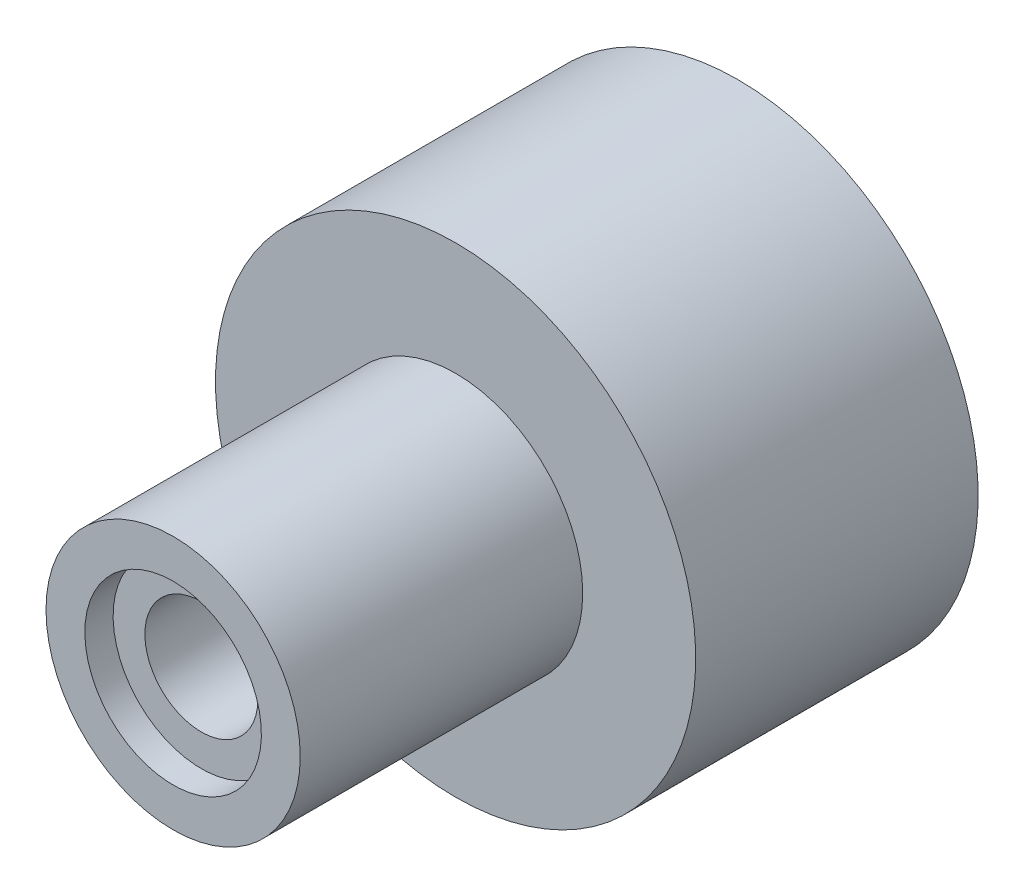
ISO-10303-21;
HEADER;
FILE_DESCRIPTION(('STEP AP214'),'2;1');
FILE_NAME('part.step','',(''),(''),'','','');
FILE_SCHEMA(('AUTOMOTIVE_DESIGN { 1 0 10303 214 1 1 1 1 }'));
ENDSEC;
DATA;
#1=APPLICATION_CONTEXT('core data for automotive mechanical design processes');
#2=APPLICATION_PROTOCOL_DEFINITION('international standard','automotive_design',2000,#1);
#3=PRODUCT_CONTEXT('',#1,'mechanical');
#4=PRODUCT('Part','Part','',(#3));
#5=PRODUCT_RELATED_PRODUCT_CATEGORY('part','',(#4));
#6=PRODUCT_DEFINITION_FORMATION('','',#4);
#7=PRODUCT_DEFINITION_CONTEXT('part definition',#1,'design');
#8=PRODUCT_DEFINITION('design','',#6,#7);
#9=PRODUCT_DEFINITION_SHAPE('','',#8);
#10=(LENGTH_UNIT() NAMED_UNIT(*) SI_UNIT(.MILLI.,.METRE.));
#11=(NAMED_UNIT(*) PLANE_ANGLE_UNIT() SI_UNIT($,.RADIAN.));
#12=(NAMED_UNIT(*) SI_UNIT($,.STERADIAN.) SOLID_ANGLE_UNIT());
#13=UNCERTAINTY_MEASURE_WITH_UNIT(LENGTH_MEASURE(1.E-05),#10,'distance_accuracy_value','');
#14=(GEOMETRIC_REPRESENTATION_CONTEXT(3) GLOBAL_UNCERTAINTY_ASSIGNED_CONTEXT((#13)) GLOBAL_UNIT_ASSIGNED_CONTEXT((#10,
#11,#12)) REPRESENTATION_CONTEXT('',''));
#15=CARTESIAN_POINT('',(0.,0.,0.));
#16=DIRECTION('',(0.,0.,1.));
#17=DIRECTION('',(1.,0.,0.));
#18=AXIS2_PLACEMENT_3D('',#15,#16,#17);
#19=CARTESIAN_POINT('',(0.,0.,0.));
#20=DIRECTION('',(0.,0.,-1.));
#21=DIRECTION('',(0.,1.,0.));
#22=AXIS2_PLACEMENT_3D('',#19,#20,#21);
#23=CYLINDRICAL_SURFACE('',#22,17.);
#24=CARTESIAN_POINT('',(0.,0.,20.));
#25=DIRECTION('',(0.,0.,-1.));
#26=DIRECTION('',(0.,1.,0.));
#27=AXIS2_PLACEMENT_3D('',#24,#25,#26);
#28=CIRCLE('',#27,17.);
#29=CARTESIAN_POINT('',(0.,17.,20.));
#30=VERTEX_POINT('',#29);
#31=EDGE_CURVE('E41',#30,#30,#28,.T.);
#32=ORIENTED_EDGE('',*,*,#31,.T.);
#33=EDGE_LOOP('',(#32));
#34=FACE_BOUND('',#33,.T.);
#35=CARTESIAN_POINT('',(0.,0.,0.));
#36=DIRECTION('',(0.,0.,-1.));
#37=DIRECTION('',(0.,1.,0.));
#38=AXIS2_PLACEMENT_3D('',#35,#36,#37);
#39=CIRCLE('',#38,17.);
#40=CARTESIAN_POINT('',(0.,17.,0.));
#41=VERTEX_POINT('',#40);
#42=EDGE_CURVE('E44',#41,#41,#39,.T.);
#43=ORIENTED_EDGE('',*,*,#42,.F.);
#44=EDGE_LOOP('',(#43));
#45=FACE_BOUND('',#44,.T.);
#46=ADVANCED_FACE('F12',(#34,#45),#23,.T.);
#47=CARTESIAN_POINT('',(0.,0.,0.));
#48=DIRECTION('',(0.,0.,-1.));
#49=DIRECTION('',(0.,1.,0.));
#50=AXIS2_PLACEMENT_3D('',#47,#48,#49);
#51=CYLINDRICAL_SURFACE('',#50,4.);
#52=CARTESIAN_POINT('',(0.,0.,15.));
#53=DIRECTION('',(0.,0.,-1.));
#54=DIRECTION('',(0.,1.,0.));
#55=AXIS2_PLACEMENT_3D('',#52,#53,#54);
#56=CIRCLE('',#55,4.);
#57=CARTESIAN_POINT('',(0.,4.,15.));
#58=VERTEX_POINT('',#57);
#59=EDGE_CURVE('E19',#58,#58,#56,.T.);
#60=ORIENTED_EDGE('',*,*,#59,.T.);
#61=EDGE_LOOP('',(#60));
#62=FACE_BOUND('',#61,.T.);
#63=CARTESIAN_POINT('',(0.,0.,38.));
#64=DIRECTION('',(0.,0.,-1.));
#65=DIRECTION('',(0.,1.,0.));
#66=AXIS2_PLACEMENT_3D('',#63,#64,#65);
#67=CIRCLE('',#66,4.);
#68=CARTESIAN_POINT('',(0.,4.,38.));
#69=VERTEX_POINT('',#68);
#70=EDGE_CURVE('E23',#69,#69,#67,.T.);
#71=ORIENTED_EDGE('',*,*,#70,.F.);
#72=EDGE_LOOP('',(#71));
#73=FACE_BOUND('',#72,.T.);
#74=ADVANCED_FACE('F103',(#62,#73),#51,.F.);
#75=CARTESIAN_POINT('',(0.,0.,0.));
#76=DIRECTION('',(0.,0.,-1.));
#77=DIRECTION('',(0.,1.,0.));
#78=AXIS2_PLACEMENT_3D('',#75,#76,#77);
#79=CYLINDRICAL_SURFACE('',#78,6.);
#80=CARTESIAN_POINT('',(0.,0.,0.));
#81=DIRECTION('',(0.,0.,-1.));
#82=DIRECTION('',(0.,1.,0.));
#83=AXIS2_PLACEMENT_3D('',#80,#81,#82);
#84=CIRCLE('',#83,6.);
#85=CARTESIAN_POINT('',(0.,6.,0.));
#86=VERTEX_POINT('',#85);
#87=EDGE_CURVE('E47',#86,#86,#84,.T.);
#88=ORIENTED_EDGE('',*,*,#87,.T.);
#89=EDGE_LOOP('',(#88));
#90=FACE_BOUND('',#89,.T.);
#91=CARTESIAN_POINT('',(0.,0.,15.));
#92=DIRECTION('',(0.,0.,-1.));
#93=DIRECTION('',(0.,1.,0.));
#94=AXIS2_PLACEMENT_3D('',#91,#92,#93);
#95=CIRCLE('',#94,6.);
#96=CARTESIAN_POINT('',(0.,6.,15.));
#97=VERTEX_POINT('',#96);
#98=EDGE_CURVE('E8',#97,#97,#95,.T.);
#99=ORIENTED_EDGE('',*,*,#98,.F.);
#100=EDGE_LOOP('',(#99));
#101=FACE_BOUND('',#100,.T.);
#102=ADVANCED_FACE('F14',(#90,#101),#79,.F.);
#103=CARTESIAN_POINT('',(4.,0.,15.));
#104=DIRECTION('',(0.,0.,-1.));
#105=DIRECTION('',(0.,1.,0.));
#106=AXIS2_PLACEMENT_3D('',#103,#104,#105);
#107=PLANE('',#106);
#108=ORIENTED_EDGE('',*,*,#98,.T.);
#109=EDGE_LOOP('',(#108));
#110=FACE_BOUND('',#109,.T.);
#111=ORIENTED_EDGE('',*,*,#59,.F.);
#112=EDGE_LOOP('',(#111));
#113=FACE_BOUND('',#112,.T.);
#114=ADVANCED_FACE('F102',(#110,#113),#107,.T.);
#115=CARTESIAN_POINT('',(4.,0.,38.));
#116=DIRECTION('',(0.,0.,1.));
#117=DIRECTION('',(0.,-1.,0.));
#118=AXIS2_PLACEMENT_3D('',#115,#116,#117);
#119=PLANE('',#118);
#120=ORIENTED_EDGE('',*,*,#70,.T.);
#121=EDGE_LOOP('',(#120));
#122=FACE_BOUND('',#121,.T.);
#123=CARTESIAN_POINT('',(0.,0.,38.));
#124=DIRECTION('',(0.,0.,-1.));
#125=DIRECTION('',(0.,1.,0.));
#126=AXIS2_PLACEMENT_3D('',#123,#124,#125);
#127=CIRCLE('',#126,6.25);
#128=CARTESIAN_POINT('',(0.,6.25,38.));
#129=VERTEX_POINT('',#128);
#130=EDGE_CURVE('E27',#129,#129,#127,.T.);
#131=ORIENTED_EDGE('',*,*,#130,.F.);
#132=EDGE_LOOP('',(#131));
#133=FACE_BOUND('',#132,.T.);
#134=ADVANCED_FACE('F110',(#122,#133),#119,.T.);
#135=CARTESIAN_POINT('',(0.,0.,0.));
#136=DIRECTION('',(0.,0.,-1.));
#137=DIRECTION('',(0.,1.,0.));
#138=AXIS2_PLACEMENT_3D('',#135,#136,#137);
#139=CYLINDRICAL_SURFACE('',#138,6.25);
#140=ORIENTED_EDGE('',*,*,#130,.T.);
#141=EDGE_LOOP('',(#140));
#142=FACE_BOUND('',#141,.T.);
#143=CARTESIAN_POINT('',(0.,0.,40.));
#144=DIRECTION('',(0.,0.,-1.));
#145=DIRECTION('',(0.,1.,0.));
#146=AXIS2_PLACEMENT_3D('',#143,#144,#145);
#147=CIRCLE('',#146,6.25);
#148=CARTESIAN_POINT('',(0.,6.25,40.));
#149=VERTEX_POINT('',#148);
#150=EDGE_CURVE('E32',#149,#149,#147,.T.);
#151=ORIENTED_EDGE('',*,*,#150,.F.);
#152=EDGE_LOOP('',(#151));
#153=FACE_BOUND('',#152,.T.);
#154=ADVANCED_FACE('F131',(#142,#153),#139,.F.);
#155=CARTESIAN_POINT('',(6.25,0.,40.));
#156=DIRECTION('',(0.,0.,1.));
#157=DIRECTION('',(0.,-1.,0.));
#158=AXIS2_PLACEMENT_3D('',#155,#156,#157);
#159=PLANE('',#158);
#160=ORIENTED_EDGE('',*,*,#150,.T.);
#161=EDGE_LOOP('',(#160));
#162=FACE_BOUND('',#161,.T.);
#163=CARTESIAN_POINT('',(0.,0.,40.));
#164=DIRECTION('',(0.,0.,-1.));
#165=DIRECTION('',(0.,1.,0.));
#166=AXIS2_PLACEMENT_3D('',#163,#164,#165);
#167=CIRCLE('',#166,9.);
#168=CARTESIAN_POINT('',(0.,9.,40.));
#169=VERTEX_POINT('',#168);
#170=EDGE_CURVE('E35',#169,#169,#167,.T.);
#171=ORIENTED_EDGE('',*,*,#170,.F.);
#172=EDGE_LOOP('',(#171));
#173=FACE_BOUND('',#172,.T.);
#174=ADVANCED_FACE('F127',(#162,#173),#159,.T.);
#175=CARTESIAN_POINT('',(0.,0.,0.));
#176=DIRECTION('',(0.,0.,-1.));
#177=DIRECTION('',(0.,1.,0.));
#178=AXIS2_PLACEMENT_3D('',#175,#176,#177);
#179=CYLINDRICAL_SURFACE('',#178,9.);
#180=ORIENTED_EDGE('',*,*,#170,.T.);
#181=EDGE_LOOP('',(#180));
#182=FACE_BOUND('',#181,.T.);
#183=CARTESIAN_POINT('',(0.,0.,20.));
#184=DIRECTION('',(0.,0.,-1.));
#185=DIRECTION('',(0.,1.,0.));
#186=AXIS2_PLACEMENT_3D('',#183,#184,#185);
#187=CIRCLE('',#186,9.);
#188=CARTESIAN_POINT('',(0.,9.,20.));
#189=VERTEX_POINT('',#188);
#190=EDGE_CURVE('E38',#189,#189,#187,.T.);
#191=ORIENTED_EDGE('',*,*,#190,.F.);
#192=EDGE_LOOP('',(#191));
#193=FACE_BOUND('',#192,.T.);
#194=ADVANCED_FACE('F123',(#182,#193),#179,.T.);
#195=CARTESIAN_POINT('',(9.,0.,20.));
#196=DIRECTION('',(0.,0.,1.));
#197=DIRECTION('',(0.,-1.,0.));
#198=AXIS2_PLACEMENT_3D('',#195,#196,#197);
#199=PLANE('',#198);
#200=ORIENTED_EDGE('',*,*,#190,.T.);
#201=EDGE_LOOP('',(#200));
#202=FACE_BOUND('',#201,.T.);
#203=ORIENTED_EDGE('',*,*,#31,.F.);
#204=EDGE_LOOP('',(#203));
#205=FACE_BOUND('',#204,.T.);
#206=ADVANCED_FACE('F89',(#202,#205),#199,.T.);
#207=CARTESIAN_POINT('',(17.,0.,0.));
#208=DIRECTION('',(0.,0.,-1.));
#209=DIRECTION('',(0.,1.,0.));
#210=AXIS2_PLACEMENT_3D('',#207,#208,#209);
#211=PLANE('',#210);
#212=CARTESIAN_POINT('',(8.83883476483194,8.83883476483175,0.));
#213=DIRECTION('',(0.,0.,-1.));
#214=DIRECTION('',(0.,1.,0.));
#215=AXIS2_PLACEMENT_3D('',#212,#213,#214);
#216=CIRCLE('',#215,3.);
#217=CARTESIAN_POINT('',(8.83883476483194,11.8388347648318,0.));
#218=VERTEX_POINT('',#217);
#219=EDGE_CURVE('E59',#218,#218,#216,.T.);
#220=ORIENTED_EDGE('',*,*,#219,.F.);
#221=EDGE_LOOP('',(#220));
#222=FACE_BOUND('',#221,.T.);
#223=CARTESIAN_POINT('',(-8.83883476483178,8.83883476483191,0.));
#224=DIRECTION('',(0.,0.,-1.));
#225=DIRECTION('',(0.,1.,0.));
#226=AXIS2_PLACEMENT_3D('',#223,#224,#225);
#227=CIRCLE('',#226,3.);
#228=CARTESIAN_POINT('',(-8.83883476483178,11.8388347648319,0.));
#229=VERTEX_POINT('',#228);
#230=EDGE_CURVE('E56',#229,#229,#227,.T.);
#231=ORIENTED_EDGE('',*,*,#230,.F.);
#232=EDGE_LOOP('',(#231));
#233=FACE_BOUND('',#232,.T.);
#234=CARTESIAN_POINT('',(-8.83883476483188,-8.83883476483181,0.));
#235=DIRECTION('',(0.,0.,-1.));
#236=DIRECTION('',(0.,1.,0.));
#237=AXIS2_PLACEMENT_3D('',#234,#235,#236);
#238=CIRCLE('',#237,3.);
#239=CARTESIAN_POINT('',(-8.83883476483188,-5.83883476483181,0.));
#240=VERTEX_POINT('',#239);
#241=EDGE_CURVE('E53',#240,#240,#238,.T.);
#242=ORIENTED_EDGE('',*,*,#241,.F.);
#243=EDGE_LOOP('',(#242));
#244=FACE_BOUND('',#243,.T.);
#245=CARTESIAN_POINT('',(8.83883476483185,-8.83883476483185,0.));
#246=DIRECTION('',(0.,0.,-1.));
#247=DIRECTION('',(0.,1.,0.));
#248=AXIS2_PLACEMENT_3D('',#245,#246,#247);
#249=CIRCLE('',#248,3.);
#250=CARTESIAN_POINT('',(8.83883476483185,-5.83883476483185,0.));
#251=VERTEX_POINT('',#250);
#252=EDGE_CURVE('E50',#251,#251,#249,.T.);
#253=ORIENTED_EDGE('',*,*,#252,.F.);
#254=EDGE_LOOP('',(#253));
#255=FACE_BOUND('',#254,.T.);
#256=ORIENTED_EDGE('',*,*,#42,.T.);
#257=EDGE_LOOP('',(#256));
#258=FACE_BOUND('',#257,.T.);
#259=ORIENTED_EDGE('',*,*,#87,.F.);
#260=EDGE_LOOP('',(#259));
#261=FACE_BOUND('',#260,.T.);
#262=ADVANCED_FACE('F85',(#222,#233,#244,#255,#258,#261),#211,.T.);
#263=CARTESIAN_POINT('',(8.83883476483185,-8.83883476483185,0.));
#264=DIRECTION('',(0.,0.,-1.));
#265=DIRECTION('',(0.,1.,0.));
#266=AXIS2_PLACEMENT_3D('',#263,#264,#265);
#267=CYLINDRICAL_SURFACE('',#266,3.);
#268=CARTESIAN_POINT('',(8.83883476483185,-8.83883476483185,9.));
#269=DIRECTION('',(0.,0.,-1.));
#270=DIRECTION('',(-1.,0.,0.));
#271=AXIS2_PLACEMENT_3D('',#268,#269,#270);
#272=CIRCLE('',#271,3.);
#273=CARTESIAN_POINT('',(5.83883476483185,-8.83883476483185,9.));
#274=VERTEX_POINT('',#273);
#275=EDGE_CURVE('E65',#274,#274,#272,.T.);
#276=ORIENTED_EDGE('',*,*,#275,.F.);
#277=EDGE_LOOP('',(#276));
#278=FACE_BOUND('',#277,.T.);
#279=ORIENTED_EDGE('',*,*,#252,.T.);
#280=EDGE_LOOP('',(#279));
#281=FACE_BOUND('',#280,.T.);
#282=ADVANCED_FACE('F88',(#278,#281),#267,.F.);
#283=CARTESIAN_POINT('',(-8.83883476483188,-8.83883476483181,0.));
#284=DIRECTION('',(0.,0.,-1.));
#285=DIRECTION('',(0.,1.,0.));
#286=AXIS2_PLACEMENT_3D('',#283,#284,#285);
#287=CYLINDRICAL_SURFACE('',#286,3.);
#288=CARTESIAN_POINT('',(-8.83883476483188,-8.83883476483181,9.));
#289=DIRECTION('',(0.,0.,-1.));
#290=DIRECTION('',(-1.,0.,0.));
#291=AXIS2_PLACEMENT_3D('',#288,#289,#290);
#292=CIRCLE('',#291,3.);
#293=CARTESIAN_POINT('',(-11.8388347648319,-8.83883476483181,9.));
#294=VERTEX_POINT('',#293);
#295=EDGE_CURVE('E62',#294,#294,#292,.T.);
#296=ORIENTED_EDGE('',*,*,#295,.F.);
#297=EDGE_LOOP('',(#296));
#298=FACE_BOUND('',#297,.T.);
#299=ORIENTED_EDGE('',*,*,#241,.T.);
#300=EDGE_LOOP('',(#299));
#301=FACE_BOUND('',#300,.T.);
#302=ADVANCED_FACE('F81',(#298,#301),#287,.F.);
#303=CARTESIAN_POINT('',(-8.83883476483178,8.83883476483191,0.));
#304=DIRECTION('',(0.,0.,-1.));
#305=DIRECTION('',(0.,1.,0.));
#306=AXIS2_PLACEMENT_3D('',#303,#304,#305);
#307=CYLINDRICAL_SURFACE('',#306,3.);
#308=CARTESIAN_POINT('',(-8.83883476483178,8.83883476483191,9.));
#309=DIRECTION('',(0.,0.,-1.));
#310=DIRECTION('',(-1.,0.,0.));
#311=AXIS2_PLACEMENT_3D('',#308,#309,#310);
#312=CIRCLE('',#311,3.);
#313=CARTESIAN_POINT('',(-11.8388347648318,8.83883476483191,9.));
#314=VERTEX_POINT('',#313);
#315=EDGE_CURVE('E71',#314,#314,#312,.T.);
#316=ORIENTED_EDGE('',*,*,#315,.F.);
#317=EDGE_LOOP('',(#316));
#318=FACE_BOUND('',#317,.T.);
#319=ORIENTED_EDGE('',*,*,#230,.T.);
#320=EDGE_LOOP('',(#319));
#321=FACE_BOUND('',#320,.T.);
#322=ADVANCED_FACE('F77',(#318,#321),#307,.F.);
#323=CARTESIAN_POINT('',(8.83883476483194,8.83883476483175,0.));
#324=DIRECTION('',(0.,0.,-1.));
#325=DIRECTION('',(0.,1.,0.));
#326=AXIS2_PLACEMENT_3D('',#323,#324,#325);
#327=CYLINDRICAL_SURFACE('',#326,3.);
#328=CARTESIAN_POINT('',(8.83883476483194,8.83883476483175,9.));
#329=DIRECTION('',(0.,0.,-1.));
#330=DIRECTION('',(-1.,0.,0.));
#331=AXIS2_PLACEMENT_3D('',#328,#329,#330);
#332=CIRCLE('',#331,3.);
#333=CARTESIAN_POINT('',(5.83883476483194,8.83883476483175,9.));
#334=VERTEX_POINT('',#333);
#335=EDGE_CURVE('E68',#334,#334,#332,.T.);
#336=ORIENTED_EDGE('',*,*,#335,.F.);
#337=EDGE_LOOP('',(#336));
#338=FACE_BOUND('',#337,.T.);
#339=ORIENTED_EDGE('',*,*,#219,.T.);
#340=EDGE_LOOP('',(#339));
#341=FACE_BOUND('',#340,.T.);
#342=ADVANCED_FACE('F80',(#338,#341),#327,.F.);
#343=CARTESIAN_POINT('',(-8.83883476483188,-8.83883476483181,9.));
#344=DIRECTION('',(0.,0.,-1.));
#345=DIRECTION('',(-1.,0.,0.));
#346=AXIS2_PLACEMENT_3D('',#343,#344,#345);
#347=PLANE('',#346);
#348=ORIENTED_EDGE('',*,*,#295,.T.);
#349=EDGE_LOOP('',(#348));
#350=FACE_BOUND('',#349,.T.);
#351=ADVANCED_FACE('F211',(#350),#347,.T.);
#352=CARTESIAN_POINT('',(8.83883476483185,-8.83883476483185,9.));
#353=DIRECTION('',(0.,0.,-1.));
#354=DIRECTION('',(-1.,0.,0.));
#355=AXIS2_PLACEMENT_3D('',#352,#353,#354);
#356=PLANE('',#355);
#357=ORIENTED_EDGE('',*,*,#275,.T.);
#358=EDGE_LOOP('',(#357));
#359=FACE_BOUND('',#358,.T.);
#360=ADVANCED_FACE('F220',(#359),#356,.T.);
#361=CARTESIAN_POINT('',(8.83883476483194,8.83883476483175,9.));
#362=DIRECTION('',(0.,0.,-1.));
#363=DIRECTION('',(-1.,0.,0.));
#364=AXIS2_PLACEMENT_3D('',#361,#362,#363);
#365=PLANE('',#364);
#366=ORIENTED_EDGE('',*,*,#335,.T.);
#367=EDGE_LOOP('',(#366));
#368=FACE_BOUND('',#367,.T.);
#369=ADVANCED_FACE('F229',(#368),#365,.T.);
#370=CARTESIAN_POINT('',(-8.83883476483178,8.83883476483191,9.));
#371=DIRECTION('',(0.,0.,-1.));
#372=DIRECTION('',(-1.,0.,0.));
#373=AXIS2_PLACEMENT_3D('',#370,#371,#372);
#374=PLANE('',#373);
#375=ORIENTED_EDGE('',*,*,#315,.T.);
#376=EDGE_LOOP('',(#375));
#377=FACE_BOUND('',#376,.T.);
#378=ADVANCED_FACE('F75',(#377),#374,.T.);
#379=CLOSED_SHELL('',(#46,#74,#102,#114,#134,#154,#174,#194,#206,#262,#282,#302,#322,#342,#351,
#360,#369,#378));
#380=MANIFOLD_SOLID_BREP('B1',#379);
#381=ADVANCED_BREP_SHAPE_REPRESENTATION('',(#18,#380),#14);
#382=SHAPE_DEFINITION_REPRESENTATION(#9,#381);
ENDSEC;
END-ISO-10303-21;
